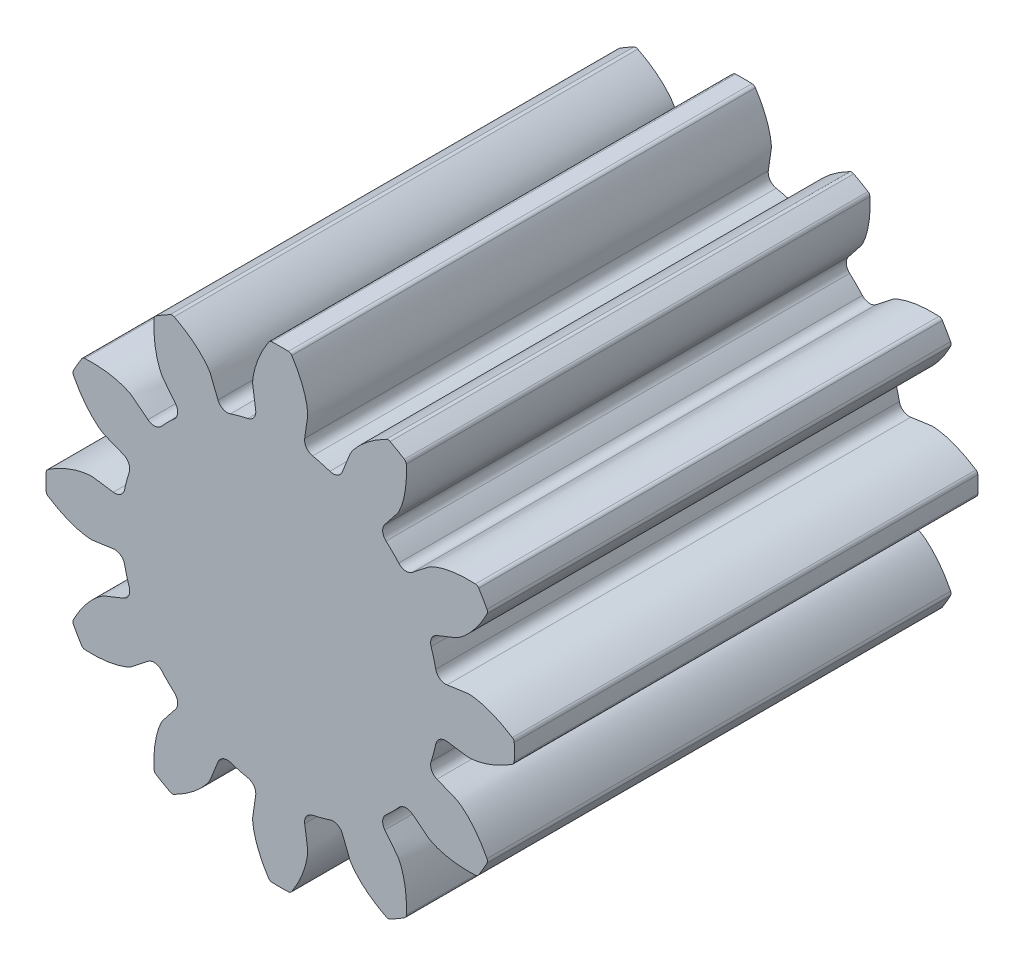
from build123d import *

# Parameters (mm, degrees)
FIRST_TOOTH_DEPTH      = 11
SKETCH3_R              = 3.7703125
ROOT_CIRCLE_DEPTH      = 11
ROOT_FILLET_R          = 0.238125
TIP_RADIUS_R           = 0.09921875
TEETH_COUNT            = 12
ROOT_FILLET_OF_TEETH_R = 0.238125
TIP_RADIUS_OF_TEETH_R  = 0.09921875


with BuildPart() as part:
    # Sketch2 → First Tooth (new body)
    with BuildSketch(Plane.XY):
        with BuildLine():
            ThreePointArc((0.24633484, 5.55078672), (0, 5.55625), (-0.24633484, 5.55078672))
            add(Edge.make_bspline(
                [(-0.24633484, 5.55078672), (-0.278427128, 5.502855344), (-0.324684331, 5.429692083), (-0.382140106, 5.329634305), (-0.422990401, 5.253346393), (-0.461451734, 5.175825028), (-0.497355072, 5.097084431), (-0.530503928, 5.017142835), (-0.560664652, 4.936023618), (-0.587553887, 4.853758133), (-0.610808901, 4.770386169), (-0.629968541, 4.685972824), (-0.644301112, 4.600580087), (-0.652916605, 4.514447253), (-0.652843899, 4.427522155), (-0.636924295, 4.342270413), (-0.62525083, 4.2565703), (-0.612439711, 4.170990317), (-0.599933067, 4.085378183), (-0.50401383, 3.43302968), (-0.413604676, 2.80907693), (-0.325101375, 2.213900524)],
                knots=[0, 0, 0, 0, 0.05017347, 0.075260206, 0.100346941, 0.125433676, 0.150520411, 0.175607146, 0.200693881, 0.225780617, 0.250867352, 0.275954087, 0.301040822, 0.326127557, 0.351214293, 0.376301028, 0.401387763, 0.426474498, 0.451561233, 0.476647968, 1, 1, 1, 1], degree=3))
            ThreePointArc((-0.325101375, 2.213900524), (0, -2.237643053), (0.325101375, 2.213900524))
            add(Edge.make_bspline(
                [(0.24633484, 5.55078672), (0.278427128, 5.502855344), (0.324684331, 5.429692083), (0.382140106, 5.329634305), (0.422990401, 5.253346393), (0.461451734, 5.175825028), (0.497355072, 5.097084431), (0.530503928, 5.017142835), (0.560664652, 4.936023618), (0.587553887, 4.853758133), (0.610808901, 4.770386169), (0.629968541, 4.685972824), (0.644301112, 4.600580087), (0.652916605, 4.514447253), (0.652843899, 4.427522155), (0.636924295, 4.342270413), (0.62525083, 4.2565703), (0.612439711, 4.170990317), (0.599933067, 4.085378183), (0.50401383, 3.43302968), (0.413604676, 2.80907693), (0.325101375, 2.213900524)],
                knots=[0, 0, 0, 0, 0.05017347, 0.075260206, 0.100346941, 0.125433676, 0.150520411, 0.175607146, 0.200693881, 0.225780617, 0.250867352, 0.275954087, 0.301040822, 0.326127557, 0.351214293, 0.376301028, 0.401387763, 0.426474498, 0.451561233, 0.476647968, 1, 1, 1, 1], degree=3))
        make_face()
    first_tooth = extrude(amount=FIRST_TOOTH_DEPTH)

    # Sketch3 → Root Circle (add)
    with BuildSketch(Plane.XY.offset(11)):
        Circle(SKETCH3_R)
    extrude(amount=-ROOT_CIRCLE_DEPTH)

    # Root Fillet
    root_fillet_edges = [part.edges().sort_by_distance(p)[0] for p in [
        (0.547823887, 3.730300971, 5.5),
        (-0.547823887, 3.730300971, 5.5),
    ]]
    fillet(root_fillet_edges, radius=ROOT_FILLET_R)

    # Tip Radius
    tip_radius_edges = [part.edges().sort_by_distance(p)[0] for p in [
        (-0.24633484, 5.55078672, 5.5),
        (0.24633484, 5.55078672, 5.5),
    ]]
    fillet(tip_radius_edges, radius=TIP_RADIUS_R)

    # Teeth: First Tooth ×12 about axis
    teeth_axis = Axis((0, 0, 11), (0, 0, -1))
    for i in range(1, TEETH_COUNT):
        add(first_tooth.rotate(teeth_axis, i * 360 / TEETH_COUNT))

    # Root Fillet of Teeth
    root_fillet_of_teeth_edges = [part.edges().sort_by_distance(p)[0] for p in [
        (2.339579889, 2.956623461, 5.5),
        (1.390721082, 3.504447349, 5.5),
        (3.504447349, 1.390721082, 5.5),
        (2.956623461, 2.339579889, 5.5),
        (3.730300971, -0.547823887, 5.5),
        (3.730300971, 0.547823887, 5.5),
        (2.956623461, -2.339579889, 5.5),
        (3.504447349, -1.390721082, 5.5),
        (1.390721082, -3.504447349, 5.5),
        (2.339579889, -2.956623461, 5.5),
        (-0.547823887, -3.730300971, 5.5),
        (0.547823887, -3.730300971, 5.5),
        (-2.339579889, -2.956623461, 5.5),
        (-1.390721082, -3.504447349, 5.5),
        (-3.504447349, -1.390721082, 5.5),
        (-2.956623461, -2.339579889, 5.5),
        (-3.730300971, 0.547823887, 5.5),
        (-3.730300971, -0.547823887, 5.5),
        (-2.956623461, 2.339579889, 5.5),
        (-3.504447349, 1.390721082, 5.5),
        (-1.390721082, 3.504447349, 5.5),
        (-2.339579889, 2.956623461, 5.5),
    ]]
    fillet(root_fillet_of_teeth_edges, radius=ROOT_FILLET_OF_TEETH_R)

    # Tip Radius of Teeth
    tip_radius_of_teeth_edges = [part.edges().sort_by_distance(p)[0] for p in [
        (2.56206113, 4.930289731, 5.5),
        (2.98872559, 4.68395489, 5.5),
        (4.68395489, 2.98872559, 5.5),
        (4.930289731, 2.56206113, 5.5),
        (5.55078672, 0.24633484, 5.5),
        (5.55078672, -0.24633484, 5.5),
        (4.930289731, -2.56206113, 5.5),
        (4.68395489, -2.98872559, 5.5),
        (2.98872559, -4.68395489, 5.5),
        (2.56206113, -4.930289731, 5.5),
        (0.24633484, -5.55078672, 5.5),
        (-0.24633484, -5.55078672, 5.5),
        (-2.56206113, -4.930289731, 5.5),
        (-2.98872559, -4.68395489, 5.5),
        (-4.68395489, -2.98872559, 5.5),
        (-4.930289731, -2.56206113, 5.5),
        (-5.55078672, -0.24633484, 5.5),
        (-5.55078672, 0.24633484, 5.5),
        (-4.930289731, 2.56206113, 5.5),
        (-4.68395489, 2.98872559, 5.5),
        (-2.98872559, 4.68395489, 5.5),
        (-2.56206113, 4.930289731, 5.5),
    ]]
    fillet(tip_radius_of_teeth_edges, radius=TIP_RADIUS_OF_TEETH_R)


solid = part.part
